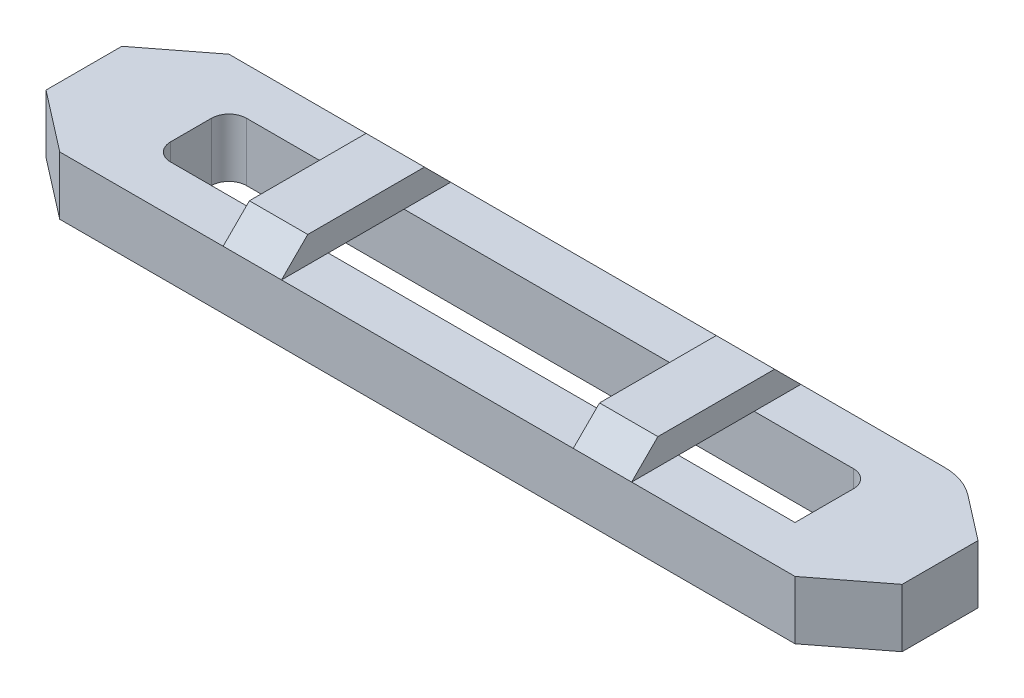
from build123d import *

# Parameters (mm, degrees)
EXTRUIR1_DEPTH = 10
EXTRUIR3_DEPTH = 5
REDONDEO1_R    = 10


with BuildPart() as part:
    # Croquis1 → Extruir1 (new body)
    with BuildSketch(Plane(origin=(0, 0, 0), x_dir=(1, 0, 0), z_dir=(0, 1, 0))):
        Polygon((-63, 14.5), (63, 14.5), (73.355967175, 6.5), (73.355967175, -6.5), (63, -14.5), (-63, -14.5), (-73.355967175, -6.5), (-73.355967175, 6.5), align=None)
        with BuildLine():
            Line((-52, 6.5), (52, 6.5))
            ThreePointArc((52, 6.5), (54.121320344, 5.621320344), (55, 3.5))
            Line((55, 3.5), (55, -6.5))
            Line((55, -6.5), (-52, -6.5))
            ThreePointArc((-52, -6.5), (-54.121320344, -5.621320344), (-55, -3.5))
            Line((-55, -3.5), (-55, 3.5))
            ThreePointArc((-55, 3.5), (-54.121320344, 5.621320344), (-52, 6.5))
        make_face(mode=Mode.SUBTRACT)
    extrude(amount=EXTRUIR1_DEPTH)

    # Croquis4 → Extruir3 (add, symmetric)
    with BuildSketch(Plane(origin=(30, 0, 0), x_dir=(0, 0, -1), z_dir=(1, 0, 0))):
        Polygon((-14.5, 10), (14.5, 10), (10, 14.5), (-10, 14.5), align=None)
    extruir3 = extrude(amount=EXTRUIR3_DEPTH, both=True)

    # Simetr_a1: Extruir3 across plane
    add(extruir3.mirror(Plane(origin=(0, 0, 0), x_dir=(0, 0, 1), z_dir=(1, 0, 0))))

    # Redondeo1
    redondeo1_edges = [part.edges().sort_by_distance(p)[0] for p in [
        (63, 5, -14.5),
    ]]
    fillet(redondeo1_edges, radius=REDONDEO1_R)


solid = part.part
